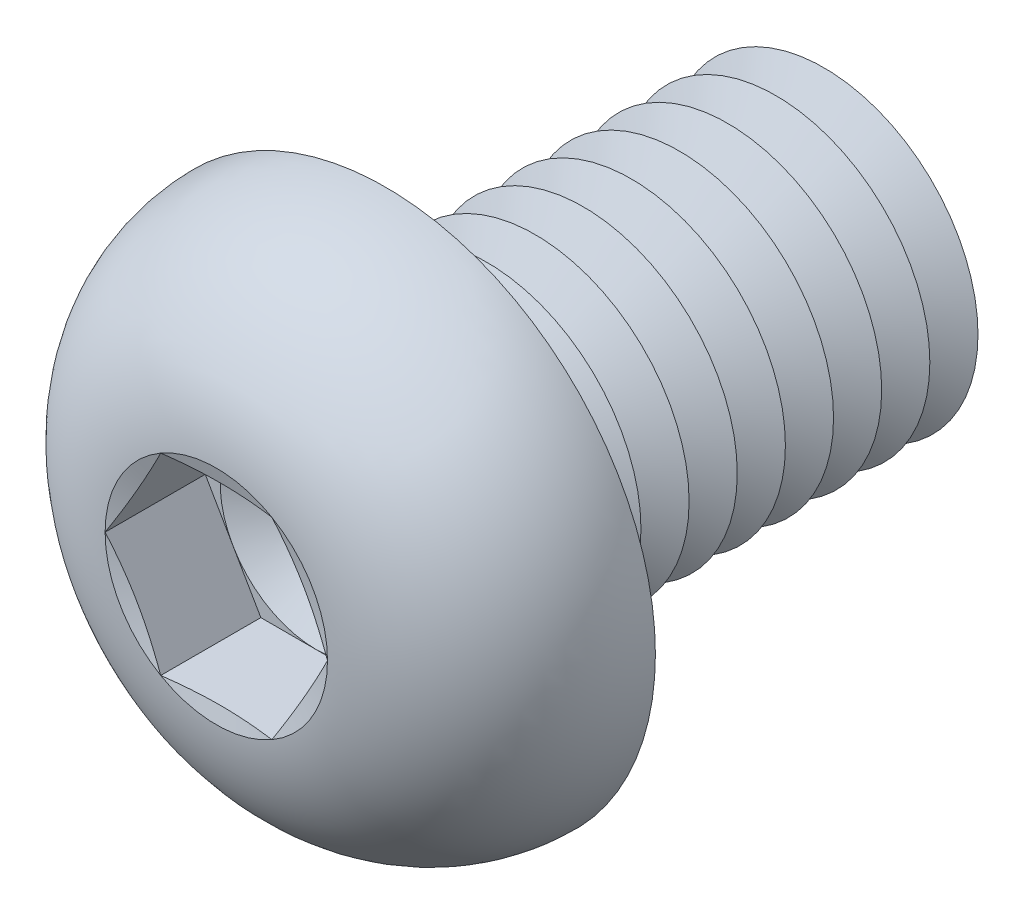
from build123d import *

# Parameters (mm, degrees)
FILLET1_R          = 0.625
LPATTERN1_COUNT    = 9
LPATTERN1_PITCH    = 1.25
CUT_EXTRUDE1_DEPTH = 2.6


with BuildPart() as part:
    # Sketch1 → Revolve1 (revolve)
    with BuildSketch(Plane(origin=(0, 0, 0), x_dir=(0, 0, -1), z_dir=(1, 0, 0)), mode=Mode.PRIVATE) as revolve1_sk:
        with BuildLine():
            Line((0, 4), (0, 7))
            ThreePointArc((0, 7), (-3.011595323, 5.81154966), (-4.4, 2.88675))
            Line((-4.4, 2.88675), (-4.013248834, 1.443375))
            Line((-4.013248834, 1.443375), (-4.4, 1.443375))
            Line((-4.4, 1.443375), (-4.4, 0))
            Line((-4.4, 0), (12, 0))
            Line((12, 0), (12, 4))
            Line((12, 4), (0, 4))
        make_face()
    revolve(revolve1_sk.sketch.rotate(Axis((0, 0, -12), (0, 0, 1)), 90), axis=Axis((0, 0, -12), (0, 0, 1)))

    # Fillet1
    fillet1_edges = [part.edges().sort_by_distance(p)[0] for p in [
        (4, 0, 0),
    ]]
    fillet(fillet1_edges, radius=FILLET1_R)

    # Sketch2 → Cut-Revolve1 (revolve, cut)
    with BuildSketch(Plane(origin=(0, 0, 0), x_dir=(0, 0, -1), z_dir=(1, 0, 0)), mode=Mode.PRIVATE) as cut_revolve1_sk:
        Polygon((11.375, 4), (12.625, 4), (12, 2.917468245), align=None)
    cut_revolve1 = revolve(cut_revolve1_sk.sketch.rotate(Axis((0, 0, -12), (0, 0, -1)), 270), axis=Axis((0, 0, -12), (0, 0, -1)), mode=Mode.SUBTRACT)

    # LPattern1: Cut-Revolve1 ×9
    with Locations(*[(0, 0, i * LPATTERN1_PITCH) for i in range(1, LPATTERN1_COUNT)]):
        add(cut_revolve1, mode=Mode.SUBTRACT)

    # Sketch3 → Cut-Extrude1 (cut)
    with BuildSketch(Plane.XY.offset(4.4)):
        Polygon((1.443375, 2.499998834), (-1.443375, 2.499998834), (-2.88675, 0), (-1.443375, -2.499998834), (1.443375, -2.499998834), (2.88675, 0), align=None)
    extrude(amount=-CUT_EXTRUDE1_DEPTH, mode=Mode.SUBTRACT)

    # Cut-Extrude2 cone 1 section (on through the dimple's axis) → Cut-Extrude2 (revolve, cut)
    with BuildSketch(Plane(origin=(0, 0, 1.8), x_dir=(0, -1, 0), z_dir=(1, 0, 0))):
        Polygon((0, 0), (2.499998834, 0), (0, 1.443375), align=None)
    revolve(axis=Axis((0, 0, 1.8), (0, 0, -1)), mode=Mode.SUBTRACT)


solid = part.part
